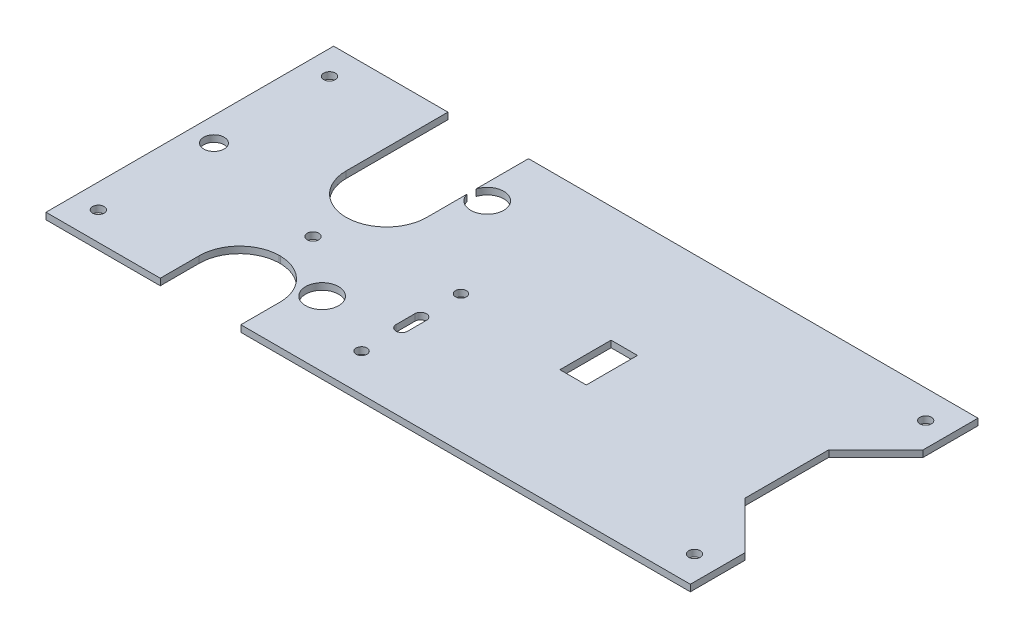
ISO-10303-21;
HEADER;
FILE_DESCRIPTION(('STEP AP214'),'2;1');
FILE_NAME('part.step','',(''),(''),'','','');
FILE_SCHEMA(('AUTOMOTIVE_DESIGN { 1 0 10303 214 1 1 1 1 }'));
ENDSEC;
DATA;
#1=APPLICATION_CONTEXT('core data for automotive mechanical design processes');
#2=APPLICATION_PROTOCOL_DEFINITION('international standard','automotive_design',2000,#1);
#3=PRODUCT_CONTEXT('',#1,'mechanical');
#4=PRODUCT('Part','Part','',(#3));
#5=PRODUCT_RELATED_PRODUCT_CATEGORY('part','',(#4));
#6=PRODUCT_DEFINITION_FORMATION('','',#4);
#7=PRODUCT_DEFINITION_CONTEXT('part definition',#1,'design');
#8=PRODUCT_DEFINITION('design','',#6,#7);
#9=PRODUCT_DEFINITION_SHAPE('','',#8);
#10=(LENGTH_UNIT() NAMED_UNIT(*) SI_UNIT(.MILLI.,.METRE.));
#11=(NAMED_UNIT(*) PLANE_ANGLE_UNIT() SI_UNIT($,.RADIAN.));
#12=(NAMED_UNIT(*) SI_UNIT($,.STERADIAN.) SOLID_ANGLE_UNIT());
#13=UNCERTAINTY_MEASURE_WITH_UNIT(LENGTH_MEASURE(1.E-05),#10,'distance_accuracy_value','');
#14=(GEOMETRIC_REPRESENTATION_CONTEXT(3) GLOBAL_UNCERTAINTY_ASSIGNED_CONTEXT((#13)) GLOBAL_UNIT_ASSIGNED_CONTEXT((#10,
#11,#12)) REPRESENTATION_CONTEXT('',''));
#15=CARTESIAN_POINT('',(0.,0.,0.));
#16=DIRECTION('',(0.,0.,1.));
#17=DIRECTION('',(1.,0.,0.));
#18=AXIS2_PLACEMENT_3D('',#15,#16,#17);
#19=CARTESIAN_POINT('',(0.,2.,-6.49709519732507));
#20=DIRECTION('',(0.,0.,-1.));
#21=DIRECTION('',(-1.,0.,0.));
#22=AXIS2_PLACEMENT_3D('',#19,#20,#21);
#23=PLANE('',#22);
#24=DIRECTION('',(1.,0.,0.));
#25=VECTOR('',#24,1.);
#26=CARTESIAN_POINT('',(0.,0.,-6.49709519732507));
#27=LINE('',#26,#25);
#28=CARTESIAN_POINT('',(29.8823938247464,0.,-6.49709519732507));
#29=VERTEX_POINT('',#28);
#30=CARTESIAN_POINT('',(37.8823938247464,0.,-6.49709519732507));
#31=VERTEX_POINT('',#30);
#32=EDGE_CURVE('E640',#29,#31,#27,.T.);
#33=ORIENTED_EDGE('',*,*,#32,.T.);
#34=DIRECTION('',(0.,-1.,0.));
#35=VECTOR('',#34,1.);
#36=CARTESIAN_POINT('',(37.8823938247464,2.,-6.49709519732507));
#37=LINE('',#36,#35);
#38=CARTESIAN_POINT('',(37.8823938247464,2.,-6.49709519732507));
#39=VERTEX_POINT('',#38);
#40=EDGE_CURVE('E12',#39,#31,#37,.T.);
#41=ORIENTED_EDGE('',*,*,#40,.F.);
#42=DIRECTION('',(1.,0.,0.));
#43=VECTOR('',#42,1.);
#44=CARTESIAN_POINT('',(0.,2.,-6.49709519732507));
#45=LINE('',#44,#43);
#46=CARTESIAN_POINT('',(29.8823938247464,2.,-6.49709519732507));
#47=VERTEX_POINT('',#46);
#48=EDGE_CURVE('E251',#47,#39,#45,.T.);
#49=ORIENTED_EDGE('',*,*,#48,.F.);
#50=DIRECTION('',(0.,-1.,0.));
#51=VECTOR('',#50,1.);
#52=CARTESIAN_POINT('',(29.8823938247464,2.,-6.49709519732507));
#53=LINE('',#52,#51);
#54=EDGE_CURVE('E59',#47,#29,#53,.T.);
#55=ORIENTED_EDGE('',*,*,#54,.T.);
#56=EDGE_LOOP('',(#33,#41,#49,#55));
#57=FACE_BOUND('',#56,.T.);
#58=ADVANCED_FACE('F40',(#57),#23,.F.);
#59=CARTESIAN_POINT('',(37.8823938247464,2.,0.));
#60=DIRECTION('',(1.,0.,0.));
#61=DIRECTION('',(0.,0.,-1.));
#62=AXIS2_PLACEMENT_3D('',#59,#60,#61);
#63=PLANE('',#62);
#64=DIRECTION('',(0.,0.,1.));
#65=VECTOR('',#64,1.);
#66=CARTESIAN_POINT('',(37.8823938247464,0.,0.));
#67=LINE('',#66,#65);
#68=CARTESIAN_POINT('',(37.8823938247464,0.,9.00290480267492));
#69=VERTEX_POINT('',#68);
#70=EDGE_CURVE('E258',#31,#69,#67,.T.);
#71=ORIENTED_EDGE('',*,*,#70,.T.);
#72=DIRECTION('',(0.,-1.,0.));
#73=VECTOR('',#72,1.);
#74=CARTESIAN_POINT('',(37.8823938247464,2.,9.00290480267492));
#75=LINE('',#74,#73);
#76=CARTESIAN_POINT('',(37.8823938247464,2.,9.00290480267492));
#77=VERTEX_POINT('',#76);
#78=EDGE_CURVE('E50',#77,#69,#75,.T.);
#79=ORIENTED_EDGE('',*,*,#78,.F.);
#80=DIRECTION('',(0.,0.,1.));
#81=VECTOR('',#80,1.);
#82=CARTESIAN_POINT('',(37.8823938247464,2.,0.));
#83=LINE('',#82,#81);
#84=EDGE_CURVE('E245',#39,#77,#83,.T.);
#85=ORIENTED_EDGE('',*,*,#84,.F.);
#86=ORIENTED_EDGE('',*,*,#40,.T.);
#87=EDGE_LOOP('',(#71,#79,#85,#86));
#88=FACE_BOUND('',#87,.T.);
#89=ADVANCED_FACE('F257',(#88),#63,.F.);
#90=CARTESIAN_POINT('',(0.,2.,9.00290480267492));
#91=DIRECTION('',(0.,0.,-1.));
#92=DIRECTION('',(-1.,0.,0.));
#93=AXIS2_PLACEMENT_3D('',#90,#91,#92);
#94=PLANE('',#93);
#95=DIRECTION('',(1.,0.,0.));
#96=VECTOR('',#95,1.);
#97=CARTESIAN_POINT('',(0.,0.,9.00290480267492));
#98=LINE('',#97,#96);
#99=CARTESIAN_POINT('',(29.8823938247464,0.,9.00290480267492));
#100=VERTEX_POINT('',#99);
#101=EDGE_CURVE('E467',#100,#69,#98,.T.);
#102=ORIENTED_EDGE('',*,*,#101,.F.);
#103=DIRECTION('',(0.,-1.,0.));
#104=VECTOR('',#103,1.);
#105=CARTESIAN_POINT('',(29.8823938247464,2.,9.00290480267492));
#106=LINE('',#105,#104);
#107=CARTESIAN_POINT('',(29.8823938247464,2.,9.00290480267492));
#108=VERTEX_POINT('',#107);
#109=EDGE_CURVE('E151',#108,#100,#106,.T.);
#110=ORIENTED_EDGE('',*,*,#109,.F.);
#111=DIRECTION('',(1.,0.,0.));
#112=VECTOR('',#111,1.);
#113=CARTESIAN_POINT('',(0.,2.,9.00290480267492));
#114=LINE('',#113,#112);
#115=EDGE_CURVE('E250',#108,#77,#114,.T.);
#116=ORIENTED_EDGE('',*,*,#115,.T.);
#117=ORIENTED_EDGE('',*,*,#78,.T.);
#118=EDGE_LOOP('',(#102,#110,#116,#117));
#119=FACE_BOUND('',#118,.T.);
#120=ADVANCED_FACE('F262',(#119),#94,.T.);
#121=CARTESIAN_POINT('',(-25.4176286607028,2.,-24.2971031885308));
#122=DIRECTION('',(0.,-1.,0.));
#123=DIRECTION('',(0.,0.,-1.));
#124=AXIS2_PLACEMENT_3D('',#121,#122,#123);
#125=CYLINDRICAL_SURFACE('',#124,4.99999999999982);
#126=CARTESIAN_POINT('',(-25.4176286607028,0.,-24.2971031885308));
#127=DIRECTION('',(0.,1.,0.));
#128=DIRECTION('',(0.,0.,1.));
#129=AXIS2_PLACEMENT_3D('',#126,#127,#128);
#130=CIRCLE('',#129,4.99999999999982);
#131=CARTESIAN_POINT('',(-30.2176061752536,0.,-22.8970260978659));
#132=VERTEX_POINT('',#131);
#133=CARTESIAN_POINT('',(-30.2176061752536,0.,-25.6971802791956));
#134=VERTEX_POINT('',#133);
#135=EDGE_CURVE('E553',#132,#134,#130,.T.);
#136=ORIENTED_EDGE('',*,*,#135,.F.);
#137=DIRECTION('',(0.,-1.,0.));
#138=VECTOR('',#137,1.);
#139=CARTESIAN_POINT('',(-30.2176061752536,2.,-22.8970260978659));
#140=LINE('',#139,#138);
#141=CARTESIAN_POINT('',(-30.2176061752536,2.,-22.8970260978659));
#142=VERTEX_POINT('',#141);
#143=EDGE_CURVE('E474',#142,#132,#140,.T.);
#144=ORIENTED_EDGE('',*,*,#143,.F.);
#145=CARTESIAN_POINT('',(-25.4176286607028,2.,-24.2971031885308));
#146=DIRECTION('',(0.,1.,0.));
#147=DIRECTION('',(0.,0.,1.));
#148=AXIS2_PLACEMENT_3D('',#145,#146,#147);
#149=CIRCLE('',#148,4.99999999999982);
#150=CARTESIAN_POINT('',(-30.2176061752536,2.,-25.6971802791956));
#151=VERTEX_POINT('',#150);
#152=EDGE_CURVE('E430',#142,#151,#149,.T.);
#153=ORIENTED_EDGE('',*,*,#152,.T.);
#154=DIRECTION('',(0.,-1.,0.));
#155=VECTOR('',#154,1.);
#156=CARTESIAN_POINT('',(-30.2176061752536,2.,-25.6971802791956));
#157=LINE('',#156,#155);
#158=EDGE_CURVE('E476',#151,#134,#157,.T.);
#159=ORIENTED_EDGE('',*,*,#158,.T.);
#160=EDGE_LOOP('',(#136,#144,#153,#159));
#161=FACE_BOUND('',#160,.T.);
#162=ADVANCED_FACE('F776',(#161),#125,.F.);
#163=CARTESIAN_POINT('',(-30.2176061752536,2.,0.));
#164=DIRECTION('',(-1.,0.,0.));
#165=DIRECTION('',(0.,0.,1.));
#166=AXIS2_PLACEMENT_3D('',#163,#164,#165);
#167=PLANE('',#166);
#168=DIRECTION('',(0.,0.,-1.));
#169=VECTOR('',#168,1.);
#170=CARTESIAN_POINT('',(-30.2176061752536,0.,0.));
#171=LINE('',#170,#169);
#172=CARTESIAN_POINT('',(-30.2176061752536,0.,-10.7970951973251));
#173=VERTEX_POINT('',#172);
#174=EDGE_CURVE('E556',#173,#132,#171,.T.);
#175=ORIENTED_EDGE('',*,*,#174,.F.);
#176=DIRECTION('',(0.,-1.,0.));
#177=VECTOR('',#176,1.);
#178=CARTESIAN_POINT('',(-30.2176061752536,2.,-10.7970951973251));
#179=LINE('',#178,#177);
#180=CARTESIAN_POINT('',(-30.2176061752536,2.,-10.7970951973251));
#181=VERTEX_POINT('',#180);
#182=EDGE_CURVE('E518',#181,#173,#179,.T.);
#183=ORIENTED_EDGE('',*,*,#182,.F.);
#184=DIRECTION('',(0.,0.,-1.));
#185=VECTOR('',#184,1.);
#186=CARTESIAN_POINT('',(-30.2176061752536,2.,0.));
#187=LINE('',#186,#185);
#188=EDGE_CURVE('E426',#181,#142,#187,.T.);
#189=ORIENTED_EDGE('',*,*,#188,.T.);
#190=ORIENTED_EDGE('',*,*,#143,.T.);
#191=EDGE_LOOP('',(#175,#183,#189,#190));
#192=FACE_BOUND('',#191,.T.);
#193=ADVANCED_FACE('F772',(#192),#167,.T.);
#194=CARTESIAN_POINT('',(-42.4176061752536,2.,-10.7970951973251));
#195=DIRECTION('',(0.,-1.,0.));
#196=DIRECTION('',(0.,0.,-1.));
#197=AXIS2_PLACEMENT_3D('',#194,#195,#196);
#198=CYLINDRICAL_SURFACE('',#197,12.2);
#199=CARTESIAN_POINT('',(-42.4176061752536,0.,-10.7970951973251));
#200=DIRECTION('',(0.,1.,0.));
#201=DIRECTION('',(0.,0.,1.));
#202=AXIS2_PLACEMENT_3D('',#199,#200,#201);
#203=CIRCLE('',#202,12.2);
#204=CARTESIAN_POINT('',(-42.163439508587,0.,1.40025694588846));
#205=VERTEX_POINT('',#204);
#206=EDGE_CURVE('E559',#205,#173,#203,.T.);
#207=ORIENTED_EDGE('',*,*,#206,.F.);
#208=DIRECTION('',(0.,-1.,0.));
#209=VECTOR('',#208,1.);
#210=CARTESIAN_POINT('',(-42.163439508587,2.,1.40025694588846));
#211=LINE('',#210,#209);
#212=CARTESIAN_POINT('',(-42.163439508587,2.,1.40025694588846));
#213=VERTEX_POINT('',#212);
#214=EDGE_CURVE('E516',#213,#205,#211,.T.);
#215=ORIENTED_EDGE('',*,*,#214,.F.);
#216=CARTESIAN_POINT('',(-42.4176061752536,2.,-10.7970951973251));
#217=DIRECTION('',(0.,1.,0.));
#218=DIRECTION('',(0.,0.,1.));
#219=AXIS2_PLACEMENT_3D('',#216,#217,#218);
#220=CIRCLE('',#219,12.2);
#221=EDGE_CURVE('E418',#213,#181,#220,.T.);
#222=ORIENTED_EDGE('',*,*,#221,.T.);
#223=ORIENTED_EDGE('',*,*,#182,.T.);
#224=EDGE_LOOP('',(#207,#215,#222,#223));
#225=FACE_BOUND('',#224,.T.);
#226=ADVANCED_FACE('F768',(#225),#198,.F.);
#227=CARTESIAN_POINT('',(-8.02783955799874E-13,2.,1.40025694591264));
#228=DIRECTION('',(5.7331188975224E-13,0.,-1.));
#229=DIRECTION('',(-1.,0.,-5.7331188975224E-13));
#230=AXIS2_PLACEMENT_3D('',#227,#228,#229);
#231=PLANE('',#230);
#232=DIRECTION('',(1.,0.,5.7331188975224E-13));
#233=VECTOR('',#232,1.);
#234=CARTESIAN_POINT('',(-8.02783955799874E-13,0.,1.40025694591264));
#235=LINE('',#234,#233);
#236=CARTESIAN_POINT('',(-42.671772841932,0.,1.40025694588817));
#237=VERTEX_POINT('',#236);
#238=EDGE_CURVE('E562',#237,#205,#235,.T.);
#239=ORIENTED_EDGE('',*,*,#238,.F.);
#240=DIRECTION('',(0.,-1.,0.));
#241=VECTOR('',#240,1.);
#242=CARTESIAN_POINT('',(-42.671772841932,2.,1.40025694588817));
#243=LINE('',#242,#241);
#244=CARTESIAN_POINT('',(-42.671772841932,2.,1.40025694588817));
#245=VERTEX_POINT('',#244);
#246=EDGE_CURVE('E514',#245,#237,#243,.T.);
#247=ORIENTED_EDGE('',*,*,#246,.F.);
#248=DIRECTION('',(1.,0.,5.7331188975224E-13));
#249=VECTOR('',#248,1.);
#250=CARTESIAN_POINT('',(-8.02783955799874E-13,2.,1.40025694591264));
#251=LINE('',#250,#249);
#252=EDGE_CURVE('E413',#245,#213,#251,.T.);
#253=ORIENTED_EDGE('',*,*,#252,.T.);
#254=ORIENTED_EDGE('',*,*,#214,.T.);
#255=EDGE_LOOP('',(#239,#247,#253,#254));
#256=FACE_BOUND('',#255,.T.);
#257=ADVANCED_FACE('F764',(#256),#231,.T.);
#258=CARTESIAN_POINT('',(-42.4176061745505,2.,-10.7970951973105));
#259=DIRECTION('',(0.,-1.,0.));
#260=DIRECTION('',(0.,0.,-1.));
#261=AXIS2_PLACEMENT_3D('',#258,#259,#260);
#262=CYLINDRICAL_SURFACE('',#261,12.2);
#263=CARTESIAN_POINT('',(-42.4176061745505,0.,-10.7970951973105));
#264=DIRECTION('',(0.,1.,0.));
#265=DIRECTION('',(0.,0.,1.));
#266=AXIS2_PLACEMENT_3D('',#263,#264,#265);
#267=CIRCLE('',#266,12.2);
#268=CARTESIAN_POINT('',(-54.6176061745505,0.,-10.7970951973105));
#269=VERTEX_POINT('',#268);
#270=EDGE_CURVE('E565',#269,#237,#267,.T.);
#271=ORIENTED_EDGE('',*,*,#270,.F.);
#272=DIRECTION('',(0.,-1.,0.));
#273=VECTOR('',#272,1.);
#274=CARTESIAN_POINT('',(-54.6176061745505,2.,-10.7970951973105));
#275=LINE('',#274,#273);
#276=CARTESIAN_POINT('',(-54.6176061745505,2.,-10.7970951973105));
#277=VERTEX_POINT('',#276);
#278=EDGE_CURVE('E512',#277,#269,#275,.T.);
#279=ORIENTED_EDGE('',*,*,#278,.F.);
#280=CARTESIAN_POINT('',(-42.4176061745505,2.,-10.7970951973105));
#281=DIRECTION('',(0.,1.,0.));
#282=DIRECTION('',(0.,0.,1.));
#283=AXIS2_PLACEMENT_3D('',#280,#281,#282);
#284=CIRCLE('',#283,12.2);
#285=EDGE_CURVE('E408',#277,#245,#284,.T.);
#286=ORIENTED_EDGE('',*,*,#285,.T.);
#287=ORIENTED_EDGE('',*,*,#246,.T.);
#288=EDGE_LOOP('',(#271,#279,#286,#287));
#289=FACE_BOUND('',#288,.T.);
#290=ADVANCED_FACE('F760',(#289),#262,.F.);
#291=CARTESIAN_POINT('',(-54.6176061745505,2.,0.));
#292=DIRECTION('',(1.,0.,0.));
#293=DIRECTION('',(0.,0.,-1.));
#294=AXIS2_PLACEMENT_3D('',#291,#292,#293);
#295=PLANE('',#294);
#296=DIRECTION('',(0.,0.,1.));
#297=VECTOR('',#296,1.);
#298=CARTESIAN_POINT('',(-54.6176061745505,0.,0.));
#299=LINE('',#298,#297);
#300=CARTESIAN_POINT('',(-54.6176061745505,0.,-41.5970951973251));
#301=VERTEX_POINT('',#300);
#302=EDGE_CURVE('E568',#301,#269,#299,.T.);
#303=ORIENTED_EDGE('',*,*,#302,.F.);
#304=DIRECTION('',(0.,-1.,0.));
#305=VECTOR('',#304,1.);
#306=CARTESIAN_POINT('',(-54.6176061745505,2.,-41.5970951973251));
#307=LINE('',#306,#305);
#308=CARTESIAN_POINT('',(-54.6176061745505,2.,-41.5970951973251));
#309=VERTEX_POINT('',#308);
#310=EDGE_CURVE('E510',#309,#301,#307,.T.);
#311=ORIENTED_EDGE('',*,*,#310,.F.);
#312=DIRECTION('',(0.,0.,1.));
#313=VECTOR('',#312,1.);
#314=CARTESIAN_POINT('',(-54.6176061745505,2.,0.));
#315=LINE('',#314,#313);
#316=EDGE_CURVE('E404',#309,#277,#315,.T.);
#317=ORIENTED_EDGE('',*,*,#316,.T.);
#318=ORIENTED_EDGE('',*,*,#278,.T.);
#319=EDGE_LOOP('',(#303,#311,#317,#318));
#320=FACE_BOUND('',#319,.T.);
#321=ADVANCED_FACE('F756',(#320),#295,.T.);
#322=CARTESIAN_POINT('',(0.,2.,-41.5970951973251));
#323=DIRECTION('',(0.,0.,-1.));
#324=DIRECTION('',(-1.,0.,0.));
#325=AXIS2_PLACEMENT_3D('',#322,#323,#324);
#326=PLANE('',#325);
#327=DIRECTION('',(1.,0.,0.));
#328=VECTOR('',#327,1.);
#329=CARTESIAN_POINT('',(0.,0.,-41.5970951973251));
#330=LINE('',#329,#328);
#331=CARTESIAN_POINT('',(-89.2176061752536,0.,-41.5970951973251));
#332=VERTEX_POINT('',#331);
#333=EDGE_CURVE('E571',#332,#301,#330,.T.);
#334=ORIENTED_EDGE('',*,*,#333,.F.);
#335=DIRECTION('',(0.,-1.,0.));
#336=VECTOR('',#335,1.);
#337=CARTESIAN_POINT('',(-89.2176061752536,2.,-41.5970951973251));
#338=LINE('',#337,#336);
#339=CARTESIAN_POINT('',(-89.2176061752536,2.,-41.5970951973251));
#340=VERTEX_POINT('',#339);
#341=EDGE_CURVE('E508',#340,#332,#338,.T.);
#342=ORIENTED_EDGE('',*,*,#341,.F.);
#343=DIRECTION('',(1.,0.,0.));
#344=VECTOR('',#343,1.);
#345=CARTESIAN_POINT('',(0.,2.,-41.5970951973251));
#346=LINE('',#345,#344);
#347=EDGE_CURVE('E396',#340,#309,#346,.T.);
#348=ORIENTED_EDGE('',*,*,#347,.T.);
#349=ORIENTED_EDGE('',*,*,#310,.T.);
#350=EDGE_LOOP('',(#334,#342,#348,#349));
#351=FACE_BOUND('',#350,.T.);
#352=ADVANCED_FACE('F752',(#351),#326,.T.);
#353=CARTESIAN_POINT('',(-89.2176061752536,2.,0.));
#354=DIRECTION('',(1.,0.,0.));
#355=DIRECTION('',(0.,0.,-1.));
#356=AXIS2_PLACEMENT_3D('',#353,#354,#355);
#357=PLANE('',#356);
#358=DIRECTION('',(0.,0.,1.));
#359=VECTOR('',#358,1.);
#360=CARTESIAN_POINT('',(-89.2176061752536,0.,0.));
#361=LINE('',#360,#359);
#362=CARTESIAN_POINT('',(-89.2176061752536,0.,45.5029048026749));
#363=VERTEX_POINT('',#362);
#364=EDGE_CURVE('E574',#332,#363,#361,.T.);
#365=ORIENTED_EDGE('',*,*,#364,.T.);
#366=DIRECTION('',(0.,-1.,0.));
#367=VECTOR('',#366,1.);
#368=CARTESIAN_POINT('',(-89.2176061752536,2.,45.5029048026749));
#369=LINE('',#368,#367);
#370=CARTESIAN_POINT('',(-89.2176061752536,2.,45.5029048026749));
#371=VERTEX_POINT('',#370);
#372=EDGE_CURVE('E505',#371,#363,#369,.T.);
#373=ORIENTED_EDGE('',*,*,#372,.F.);
#374=DIRECTION('',(0.,0.,1.));
#375=VECTOR('',#374,1.);
#376=CARTESIAN_POINT('',(-89.2176061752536,2.,0.));
#377=LINE('',#376,#375);
#378=EDGE_CURVE('E391',#340,#371,#377,.T.);
#379=ORIENTED_EDGE('',*,*,#378,.F.);
#380=ORIENTED_EDGE('',*,*,#341,.T.);
#381=EDGE_LOOP('',(#365,#373,#379,#380));
#382=FACE_BOUND('',#381,.T.);
#383=ADVANCED_FACE('F748',(#382),#357,.F.);
#384=CARTESIAN_POINT('',(0.,2.,45.5029048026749));
#385=DIRECTION('',(0.,0.,-1.));
#386=DIRECTION('',(-1.,0.,0.));
#387=AXIS2_PLACEMENT_3D('',#384,#385,#386);
#388=PLANE('',#387);
#389=DIRECTION('',(1.,0.,0.));
#390=VECTOR('',#389,1.);
#391=CARTESIAN_POINT('',(0.,0.,45.5029048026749));
#392=LINE('',#391,#390);
#393=CARTESIAN_POINT('',(-54.6176061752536,0.,45.5029048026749));
#394=VERTEX_POINT('',#393);
#395=EDGE_CURVE('E577',#363,#394,#392,.T.);
#396=ORIENTED_EDGE('',*,*,#395,.T.);
#397=DIRECTION('',(0.,-1.,0.));
#398=VECTOR('',#397,1.);
#399=CARTESIAN_POINT('',(-54.6176061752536,2.,45.5029048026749));
#400=LINE('',#399,#398);
#401=CARTESIAN_POINT('',(-54.6176061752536,2.,45.5029048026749));
#402=VERTEX_POINT('',#401);
#403=EDGE_CURVE('E503',#402,#394,#400,.T.);
#404=ORIENTED_EDGE('',*,*,#403,.F.);
#405=DIRECTION('',(1.,0.,0.));
#406=VECTOR('',#405,1.);
#407=CARTESIAN_POINT('',(0.,2.,45.5029048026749));
#408=LINE('',#407,#406);
#409=EDGE_CURVE('E387',#371,#402,#408,.T.);
#410=ORIENTED_EDGE('',*,*,#409,.F.);
#411=ORIENTED_EDGE('',*,*,#372,.T.);
#412=EDGE_LOOP('',(#396,#404,#410,#411));
#413=FACE_BOUND('',#412,.T.);
#414=ADVANCED_FACE('F744',(#413),#388,.F.);
#415=CARTESIAN_POINT('',(-54.6176061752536,2.,0.));
#416=DIRECTION('',(1.,0.,0.));
#417=DIRECTION('',(0.,0.,-1.));
#418=AXIS2_PLACEMENT_3D('',#415,#416,#417);
#419=PLANE('',#418);
#420=DIRECTION('',(0.,0.,1.));
#421=VECTOR('',#420,1.);
#422=CARTESIAN_POINT('',(-54.6176061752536,0.,0.));
#423=LINE('',#422,#421);
#424=CARTESIAN_POINT('',(-54.6176061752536,0.,33.7029048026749));
#425=VERTEX_POINT('',#424);
#426=EDGE_CURVE('E580',#425,#394,#423,.T.);
#427=ORIENTED_EDGE('',*,*,#426,.F.);
#428=DIRECTION('',(0.,-1.,0.));
#429=VECTOR('',#428,1.);
#430=CARTESIAN_POINT('',(-54.6176061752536,2.,33.7029048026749));
#431=LINE('',#430,#429);
#432=CARTESIAN_POINT('',(-54.6176061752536,2.,33.7029048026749));
#433=VERTEX_POINT('',#432);
#434=EDGE_CURVE('E501',#433,#425,#431,.T.);
#435=ORIENTED_EDGE('',*,*,#434,.F.);
#436=DIRECTION('',(0.,0.,1.));
#437=VECTOR('',#436,1.);
#438=CARTESIAN_POINT('',(-54.6176061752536,2.,0.));
#439=LINE('',#438,#437);
#440=EDGE_CURVE('E383',#433,#402,#439,.T.);
#441=ORIENTED_EDGE('',*,*,#440,.T.);
#442=ORIENTED_EDGE('',*,*,#403,.T.);
#443=EDGE_LOOP('',(#427,#435,#441,#442));
#444=FACE_BOUND('',#443,.T.);
#445=ADVANCED_FACE('F740',(#444),#419,.T.);
#446=CARTESIAN_POINT('',(-42.4176061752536,2.,33.7029048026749));
#447=DIRECTION('',(0.,-1.,0.));
#448=DIRECTION('',(0.,0.,-1.));
#449=AXIS2_PLACEMENT_3D('',#446,#447,#448);
#450=CYLINDRICAL_SURFACE('',#449,12.2);
#451=CARTESIAN_POINT('',(-42.4176061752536,0.,33.7029048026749));
#452=DIRECTION('',(0.,1.,0.));
#453=DIRECTION('',(0.,0.,1.));
#454=AXIS2_PLACEMENT_3D('',#451,#452,#453);
#455=CIRCLE('',#454,12.2);
#456=CARTESIAN_POINT('',(-42.6689869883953,0.,21.5054949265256));
#457=VERTEX_POINT('',#456);
#458=EDGE_CURVE('E583',#457,#425,#455,.T.);
#459=ORIENTED_EDGE('',*,*,#458,.F.);
#460=DIRECTION('',(0.,-1.,0.));
#461=VECTOR('',#460,1.);
#462=CARTESIAN_POINT('',(-42.6689869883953,2.,21.5054949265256));
#463=LINE('',#462,#461);
#464=CARTESIAN_POINT('',(-42.6689869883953,2.,21.5054949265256));
#465=VERTEX_POINT('',#464);
#466=EDGE_CURVE('E499',#465,#457,#463,.T.);
#467=ORIENTED_EDGE('',*,*,#466,.F.);
#468=CARTESIAN_POINT('',(-42.4176061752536,2.,33.7029048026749));
#469=DIRECTION('',(0.,1.,0.));
#470=DIRECTION('',(0.,0.,1.));
#471=AXIS2_PLACEMENT_3D('',#468,#469,#470);
#472=CIRCLE('',#471,12.2);
#473=EDGE_CURVE('E375',#465,#433,#472,.T.);
#474=ORIENTED_EDGE('',*,*,#473,.T.);
#475=ORIENTED_EDGE('',*,*,#434,.T.);
#476=EDGE_LOOP('',(#459,#467,#474,#475));
#477=FACE_BOUND('',#476,.T.);
#478=ADVANCED_FACE('F736',(#477),#450,.F.);
#479=CARTESIAN_POINT('',(0.,2.,21.5054949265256));
#480=DIRECTION('',(0.,0.,-1.));
#481=DIRECTION('',(-1.,0.,0.));
#482=AXIS2_PLACEMENT_3D('',#479,#480,#481);
#483=PLANE('',#482);
#484=DIRECTION('',(1.,0.,0.));
#485=VECTOR('',#484,1.);
#486=CARTESIAN_POINT('',(0.,0.,21.5054949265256));
#487=LINE('',#486,#485);
#488=CARTESIAN_POINT('',(-42.1662253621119,0.,21.5054949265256));
#489=VERTEX_POINT('',#488);
#490=EDGE_CURVE('E586',#457,#489,#487,.T.);
#491=ORIENTED_EDGE('',*,*,#490,.T.);
#492=DIRECTION('',(0.,-1.,0.));
#493=VECTOR('',#492,1.);
#494=CARTESIAN_POINT('',(-42.1662253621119,2.,21.5054949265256));
#495=LINE('',#494,#493);
#496=CARTESIAN_POINT('',(-42.1662253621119,2.,21.5054949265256));
#497=VERTEX_POINT('',#496);
#498=EDGE_CURVE('E497',#497,#489,#495,.T.);
#499=ORIENTED_EDGE('',*,*,#498,.F.);
#500=DIRECTION('',(1.,0.,0.));
#501=VECTOR('',#500,1.);
#502=CARTESIAN_POINT('',(0.,2.,21.5054949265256));
#503=LINE('',#502,#501);
#504=EDGE_CURVE('E371',#465,#497,#503,.T.);
#505=ORIENTED_EDGE('',*,*,#504,.F.);
#506=ORIENTED_EDGE('',*,*,#466,.T.);
#507=EDGE_LOOP('',(#491,#499,#505,#506));
#508=FACE_BOUND('',#507,.T.);
#509=ADVANCED_FACE('F732',(#508),#483,.F.);
#510=CARTESIAN_POINT('',(-42.4176061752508,2.,33.7029048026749));
#511=DIRECTION('',(0.,-1.,0.));
#512=DIRECTION('',(0.,0.,-1.));
#513=AXIS2_PLACEMENT_3D('',#510,#511,#512);
#514=CYLINDRICAL_SURFACE('',#513,12.2);
#515=CARTESIAN_POINT('',(-42.4176061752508,0.,33.7029048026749));
#516=DIRECTION('',(0.,1.,0.));
#517=DIRECTION('',(0.,0.,1.));
#518=AXIS2_PLACEMENT_3D('',#515,#516,#517);
#519=CIRCLE('',#518,12.2);
#520=CARTESIAN_POINT('',(-30.2176061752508,0.,33.702904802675));
#521=VERTEX_POINT('',#520);
#522=EDGE_CURVE('E589',#521,#489,#519,.T.);
#523=ORIENTED_EDGE('',*,*,#522,.F.);
#524=DIRECTION('',(0.,-1.,0.));
#525=VECTOR('',#524,1.);
#526=CARTESIAN_POINT('',(-30.2176061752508,2.,33.702904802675));
#527=LINE('',#526,#525);
#528=CARTESIAN_POINT('',(-30.2176061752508,2.,33.702904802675));
#529=VERTEX_POINT('',#528);
#530=EDGE_CURVE('E495',#529,#521,#527,.T.);
#531=ORIENTED_EDGE('',*,*,#530,.F.);
#532=CARTESIAN_POINT('',(-42.4176061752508,2.,33.7029048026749));
#533=DIRECTION('',(0.,1.,0.));
#534=DIRECTION('',(0.,0.,1.));
#535=AXIS2_PLACEMENT_3D('',#532,#533,#534);
#536=CIRCLE('',#535,12.2);
#537=EDGE_CURVE('E366',#529,#497,#536,.T.);
#538=ORIENTED_EDGE('',*,*,#537,.T.);
#539=ORIENTED_EDGE('',*,*,#498,.T.);
#540=EDGE_LOOP('',(#523,#531,#538,#539));
#541=FACE_BOUND('',#540,.T.);
#542=ADVANCED_FACE('F728',(#541),#514,.F.);
#543=CARTESIAN_POINT('',(-30.2176061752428,2.,-7.21430219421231E-12));
#544=DIRECTION('',(-1.,0.,-2.38744993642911E-13));
#545=DIRECTION('',(-2.38744993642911E-13,0.,1.));
#546=AXIS2_PLACEMENT_3D('',#543,#544,#545);
#547=PLANE('',#546);
#548=DIRECTION('',(2.38744993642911E-13,0.,-1.));
#549=VECTOR('',#548,1.);
#550=CARTESIAN_POINT('',(-30.2176061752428,0.,-7.21430219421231E-12));
#551=LINE('',#550,#549);
#552=CARTESIAN_POINT('',(-30.2176061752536,0.,45.5029048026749));
#553=VERTEX_POINT('',#552);
#554=EDGE_CURVE('E592',#553,#521,#551,.T.);
#555=ORIENTED_EDGE('',*,*,#554,.F.);
#556=DIRECTION('',(0.,-1.,0.));
#557=VECTOR('',#556,1.);
#558=CARTESIAN_POINT('',(-30.2176061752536,2.,45.5029048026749));
#559=LINE('',#558,#557);
#560=CARTESIAN_POINT('',(-30.2176061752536,2.,45.5029048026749));
#561=VERTEX_POINT('',#560);
#562=EDGE_CURVE('E493',#561,#553,#559,.T.);
#563=ORIENTED_EDGE('',*,*,#562,.F.);
#564=DIRECTION('',(2.38744993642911E-13,0.,-1.));
#565=VECTOR('',#564,1.);
#566=CARTESIAN_POINT('',(-30.2176061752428,2.,-7.21430219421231E-12));
#567=LINE('',#566,#565);
#568=EDGE_CURVE('E362',#561,#529,#567,.T.);
#569=ORIENTED_EDGE('',*,*,#568,.T.);
#570=ORIENTED_EDGE('',*,*,#530,.T.);
#571=EDGE_LOOP('',(#555,#563,#569,#570));
#572=FACE_BOUND('',#571,.T.);
#573=ADVANCED_FACE('F724',(#572),#547,.T.);
#574=CARTESIAN_POINT('',(0.,2.,45.5029048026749));
#575=DIRECTION('',(0.,0.,-1.));
#576=DIRECTION('',(-1.,0.,0.));
#577=AXIS2_PLACEMENT_3D('',#574,#575,#576);
#578=PLANE('',#577);
#579=DIRECTION('',(1.,0.,0.));
#580=VECTOR('',#579,1.);
#581=CARTESIAN_POINT('',(0.,0.,45.5029048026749));
#582=LINE('',#581,#580);
#583=CARTESIAN_POINT('',(105.882393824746,0.,45.5029048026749));
#584=VERTEX_POINT('',#583);
#585=EDGE_CURVE('E595',#553,#584,#582,.T.);
#586=ORIENTED_EDGE('',*,*,#585,.T.);
#587=DIRECTION('',(0.,-1.,0.));
#588=VECTOR('',#587,1.);
#589=CARTESIAN_POINT('',(105.882393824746,2.,45.5029048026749));
#590=LINE('',#589,#588);
#591=CARTESIAN_POINT('',(105.882393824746,2.,45.5029048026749));
#592=VERTEX_POINT('',#591);
#593=EDGE_CURVE('E490',#592,#584,#590,.T.);
#594=ORIENTED_EDGE('',*,*,#593,.F.);
#595=DIRECTION('',(1.,0.,0.));
#596=VECTOR('',#595,1.);
#597=CARTESIAN_POINT('',(0.,2.,45.5029048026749));
#598=LINE('',#597,#596);
#599=EDGE_CURVE('E354',#561,#592,#598,.T.);
#600=ORIENTED_EDGE('',*,*,#599,.F.);
#601=ORIENTED_EDGE('',*,*,#562,.T.);
#602=EDGE_LOOP('',(#586,#594,#600,#601));
#603=FACE_BOUND('',#602,.T.);
#604=ADVANCED_FACE('F720',(#603),#578,.F.);
#605=CARTESIAN_POINT('',(105.882393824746,2.,0.));
#606=DIRECTION('',(-1.,0.,0.));
#607=DIRECTION('',(0.,0.,1.));
#608=AXIS2_PLACEMENT_3D('',#605,#606,#607);
#609=PLANE('',#608);
#610=DIRECTION('',(0.,0.,-1.));
#611=VECTOR('',#610,1.);
#612=CARTESIAN_POINT('',(105.882393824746,0.,0.));
#613=LINE('',#612,#611);
#614=CARTESIAN_POINT('',(105.882393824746,0.,28.9171183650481));
#615=VERTEX_POINT('',#614);
#616=EDGE_CURVE('E598',#584,#615,#613,.T.);
#617=ORIENTED_EDGE('',*,*,#616,.T.);
#618=DIRECTION('',(0.,-1.,0.));
#619=VECTOR('',#618,1.);
#620=CARTESIAN_POINT('',(105.882393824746,2.,28.9171183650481));
#621=LINE('',#620,#619);
#622=CARTESIAN_POINT('',(105.882393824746,2.,28.9171183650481));
#623=VERTEX_POINT('',#622);
#624=EDGE_CURVE('E488',#623,#615,#621,.T.);
#625=ORIENTED_EDGE('',*,*,#624,.F.);
#626=DIRECTION('',(0.,0.,-1.));
#627=VECTOR('',#626,1.);
#628=CARTESIAN_POINT('',(105.882393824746,2.,0.));
#629=LINE('',#628,#627);
#630=EDGE_CURVE('E350',#592,#623,#629,.T.);
#631=ORIENTED_EDGE('',*,*,#630,.F.);
#632=ORIENTED_EDGE('',*,*,#593,.T.);
#633=EDGE_LOOP('',(#617,#625,#631,#632));
#634=FACE_BOUND('',#633,.T.);
#635=ADVANCED_FACE('F716',(#634),#609,.F.);
#636=CARTESIAN_POINT('',(38.4826377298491,2.,-38.4826377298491));
#637=DIRECTION('',(0.707106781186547,0.,-0.707106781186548));
#638=DIRECTION('',(-0.707106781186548,0.,-0.707106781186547));
#639=AXIS2_PLACEMENT_3D('',#636,#637,#638);
#640=PLANE('',#639);
#641=DIRECTION('',(0.707106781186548,0.,0.707106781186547));
#642=VECTOR('',#641,1.);
#643=CARTESIAN_POINT('',(38.4826377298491,0.,-38.4826377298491));
#644=LINE('',#643,#642);
#645=CARTESIAN_POINT('',(91.5823938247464,0.,14.6171183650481));
#646=VERTEX_POINT('',#645);
#647=EDGE_CURVE('E601',#646,#615,#644,.T.);
#648=ORIENTED_EDGE('',*,*,#647,.F.);
#649=DIRECTION('',(0.,-1.,0.));
#650=VECTOR('',#649,1.);
#651=CARTESIAN_POINT('',(91.5823938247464,2.,14.6171183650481));
#652=LINE('',#651,#650);
#653=CARTESIAN_POINT('',(91.5823938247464,2.,14.6171183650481));
#654=VERTEX_POINT('',#653);
#655=EDGE_CURVE('E486',#654,#646,#652,.T.);
#656=ORIENTED_EDGE('',*,*,#655,.F.);
#657=DIRECTION('',(0.707106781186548,0.,0.707106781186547));
#658=VECTOR('',#657,1.);
#659=CARTESIAN_POINT('',(38.4826377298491,2.,-38.4826377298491));
#660=LINE('',#659,#658);
#661=EDGE_CURVE('E345',#654,#623,#660,.T.);
#662=ORIENTED_EDGE('',*,*,#661,.T.);
#663=ORIENTED_EDGE('',*,*,#624,.T.);
#664=EDGE_LOOP('',(#648,#656,#662,#663));
#665=FACE_BOUND('',#664,.T.);
#666=ADVANCED_FACE('F712',(#665),#640,.T.);
#667=CARTESIAN_POINT('',(91.5823938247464,2.,0.));
#668=DIRECTION('',(1.,0.,0.));
#669=DIRECTION('',(0.,0.,-1.));
#670=AXIS2_PLACEMENT_3D('',#667,#668,#669);
#671=PLANE('',#670);
#672=DIRECTION('',(0.,0.,1.));
#673=VECTOR('',#672,1.);
#674=CARTESIAN_POINT('',(91.5823938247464,0.,0.));
#675=LINE('',#674,#673);
#676=CARTESIAN_POINT('',(91.5823938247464,0.,-10.7113087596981));
#677=VERTEX_POINT('',#676);
#678=EDGE_CURVE('E604',#677,#646,#675,.T.);
#679=ORIENTED_EDGE('',*,*,#678,.F.);
#680=DIRECTION('',(0.,-1.,0.));
#681=VECTOR('',#680,1.);
#682=CARTESIAN_POINT('',(91.5823938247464,2.,-10.7113087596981));
#683=LINE('',#682,#681);
#684=CARTESIAN_POINT('',(91.5823938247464,2.,-10.7113087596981));
#685=VERTEX_POINT('',#684);
#686=EDGE_CURVE('E484',#685,#677,#683,.T.);
#687=ORIENTED_EDGE('',*,*,#686,.F.);
#688=DIRECTION('',(0.,0.,1.));
#689=VECTOR('',#688,1.);
#690=CARTESIAN_POINT('',(91.5823938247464,2.,0.));
#691=LINE('',#690,#689);
#692=EDGE_CURVE('E341',#685,#654,#691,.T.);
#693=ORIENTED_EDGE('',*,*,#692,.T.);
#694=ORIENTED_EDGE('',*,*,#655,.T.);
#695=EDGE_LOOP('',(#679,#687,#693,#694));
#696=FACE_BOUND('',#695,.T.);
#697=ADVANCED_FACE('F708',(#696),#671,.T.);
#698=CARTESIAN_POINT('',(40.4355425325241,2.,40.4355425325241));
#699=DIRECTION('',(0.707106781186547,0.,0.707106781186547));
#700=DIRECTION('',(0.707106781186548,0.,-0.707106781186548));
#701=AXIS2_PLACEMENT_3D('',#698,#699,#700);
#702=PLANE('',#701);
#703=DIRECTION('',(-0.707106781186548,0.,0.707106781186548));
#704=VECTOR('',#703,1.);
#705=CARTESIAN_POINT('',(40.4355425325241,0.,40.4355425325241));
#706=LINE('',#705,#704);
#707=CARTESIAN_POINT('',(105.882393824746,0.,-25.0113087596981));
#708=VERTEX_POINT('',#707);
#709=EDGE_CURVE('E607',#708,#677,#706,.T.);
#710=ORIENTED_EDGE('',*,*,#709,.F.);
#711=DIRECTION('',(0.,-1.,0.));
#712=VECTOR('',#711,1.);
#713=CARTESIAN_POINT('',(105.882393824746,2.,-25.0113087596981));
#714=LINE('',#713,#712);
#715=CARTESIAN_POINT('',(105.882393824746,2.,-25.0113087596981));
#716=VERTEX_POINT('',#715);
#717=EDGE_CURVE('E482',#716,#708,#714,.T.);
#718=ORIENTED_EDGE('',*,*,#717,.F.);
#719=DIRECTION('',(-0.707106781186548,0.,0.707106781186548));
#720=VECTOR('',#719,1.);
#721=CARTESIAN_POINT('',(40.4355425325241,2.,40.4355425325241));
#722=LINE('',#721,#720);
#723=EDGE_CURVE('E333',#716,#685,#722,.T.);
#724=ORIENTED_EDGE('',*,*,#723,.T.);
#725=ORIENTED_EDGE('',*,*,#686,.T.);
#726=EDGE_LOOP('',(#710,#718,#724,#725));
#727=FACE_BOUND('',#726,.T.);
#728=ADVANCED_FACE('F704',(#727),#702,.T.);
#729=CARTESIAN_POINT('',(105.882393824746,2.,0.));
#730=DIRECTION('',(-1.,0.,0.));
#731=DIRECTION('',(0.,0.,1.));
#732=AXIS2_PLACEMENT_3D('',#729,#730,#731);
#733=PLANE('',#732);
#734=DIRECTION('',(0.,0.,-1.));
#735=VECTOR('',#734,1.);
#736=CARTESIAN_POINT('',(105.882393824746,0.,0.));
#737=LINE('',#736,#735);
#738=CARTESIAN_POINT('',(105.882393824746,0.,-41.5970951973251));
#739=VERTEX_POINT('',#738);
#740=EDGE_CURVE('E610',#708,#739,#737,.T.);
#741=ORIENTED_EDGE('',*,*,#740,.T.);
#742=DIRECTION('',(0.,-1.,0.));
#743=VECTOR('',#742,1.);
#744=CARTESIAN_POINT('',(105.882393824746,2.,-41.5970951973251));
#745=LINE('',#744,#743);
#746=CARTESIAN_POINT('',(105.882393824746,2.,-41.5970951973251));
#747=VERTEX_POINT('',#746);
#748=EDGE_CURVE('E480',#747,#739,#745,.T.);
#749=ORIENTED_EDGE('',*,*,#748,.F.);
#750=DIRECTION('',(0.,0.,-1.));
#751=VECTOR('',#750,1.);
#752=CARTESIAN_POINT('',(105.882393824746,2.,0.));
#753=LINE('',#752,#751);
#754=EDGE_CURVE('E329',#716,#747,#753,.T.);
#755=ORIENTED_EDGE('',*,*,#754,.F.);
#756=ORIENTED_EDGE('',*,*,#717,.T.);
#757=EDGE_LOOP('',(#741,#749,#755,#756));
#758=FACE_BOUND('',#757,.T.);
#759=ADVANCED_FACE('F700',(#758),#733,.F.);
#760=CARTESIAN_POINT('',(0.,2.,-41.5970951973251));
#761=DIRECTION('',(0.,0.,-1.));
#762=DIRECTION('',(-1.,0.,0.));
#763=AXIS2_PLACEMENT_3D('',#760,#761,#762);
#764=PLANE('',#763);
#765=DIRECTION('',(1.,0.,0.));
#766=VECTOR('',#765,1.);
#767=CARTESIAN_POINT('',(0.,0.,-41.5970951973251));
#768=LINE('',#767,#766);
#769=CARTESIAN_POINT('',(-30.2176061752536,0.,-41.5970951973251));
#770=VERTEX_POINT('',#769);
#771=EDGE_CURVE('E613',#770,#739,#768,.T.);
#772=ORIENTED_EDGE('',*,*,#771,.F.);
#773=DIRECTION('',(0.,-1.,0.));
#774=VECTOR('',#773,1.);
#775=CARTESIAN_POINT('',(-30.2176061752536,2.,-41.5970951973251));
#776=LINE('',#775,#774);
#777=CARTESIAN_POINT('',(-30.2176061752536,2.,-41.5970951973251));
#778=VERTEX_POINT('',#777);
#779=EDGE_CURVE('E478',#778,#770,#776,.T.);
#780=ORIENTED_EDGE('',*,*,#779,.F.);
#781=DIRECTION('',(1.,0.,0.));
#782=VECTOR('',#781,1.);
#783=CARTESIAN_POINT('',(0.,2.,-41.5970951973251));
#784=LINE('',#783,#782);
#785=EDGE_CURVE('E324',#778,#747,#784,.T.);
#786=ORIENTED_EDGE('',*,*,#785,.T.);
#787=ORIENTED_EDGE('',*,*,#748,.T.);
#788=EDGE_LOOP('',(#772,#780,#786,#787));
#789=FACE_BOUND('',#788,.T.);
#790=ADVANCED_FACE('F697',(#789),#764,.T.);
#791=CARTESIAN_POINT('',(-5.01760617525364,2.,21.9529048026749));
#792=DIRECTION('',(0.,-1.,0.));
#793=DIRECTION('',(0.,0.,-1.));
#794=AXIS2_PLACEMENT_3D('',#791,#792,#793);
#795=CYLINDRICAL_SURFACE('',#794,1.75);
#796=CARTESIAN_POINT('',(-5.01760617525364,0.,21.9529048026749));
#797=DIRECTION('',(0.,1.,0.));
#798=DIRECTION('',(0.,0.,1.));
#799=AXIS2_PLACEMENT_3D('',#796,#797,#798);
#800=CIRCLE('',#799,1.75);
#801=CARTESIAN_POINT('',(-6.76760617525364,0.,21.9529048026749));
#802=VERTEX_POINT('',#801);
#803=CARTESIAN_POINT('',(-3.26760617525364,0.,21.9529048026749));
#804=VERTEX_POINT('',#803);
#805=EDGE_CURVE('E534',#802,#804,#800,.T.);
#806=ORIENTED_EDGE('',*,*,#805,.F.);
#807=DIRECTION('',(0.,-1.,0.));
#808=VECTOR('',#807,1.);
#809=CARTESIAN_POINT('',(-6.76760617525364,2.,21.9529048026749));
#810=LINE('',#809,#808);
#811=CARTESIAN_POINT('',(-6.76760617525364,2.,21.9529048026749));
#812=VERTEX_POINT('',#811);
#813=EDGE_CURVE('E44',#812,#802,#810,.T.);
#814=ORIENTED_EDGE('',*,*,#813,.F.);
#815=CARTESIAN_POINT('',(-5.01760617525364,2.,21.9529048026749));
#816=DIRECTION('',(0.,1.,0.));
#817=DIRECTION('',(0.,0.,1.));
#818=AXIS2_PLACEMENT_3D('',#815,#816,#817);
#819=CIRCLE('',#818,1.75);
#820=CARTESIAN_POINT('',(-3.26760617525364,2.,21.9529048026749));
#821=VERTEX_POINT('',#820);
#822=EDGE_CURVE('E461',#812,#821,#819,.T.);
#823=ORIENTED_EDGE('',*,*,#822,.T.);
#824=DIRECTION('',(0.,-1.,0.));
#825=VECTOR('',#824,1.);
#826=CARTESIAN_POINT('',(-3.26760617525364,2.,21.9529048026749));
#827=LINE('',#826,#825);
#828=EDGE_CURVE('E267',#821,#804,#827,.T.);
#829=ORIENTED_EDGE('',*,*,#828,.T.);
#830=EDGE_LOOP('',(#806,#814,#823,#829));
#831=FACE_BOUND('',#830,.T.);
#832=ADVANCED_FACE('F42',(#831),#795,.F.);
#833=CARTESIAN_POINT('',(-6.76760617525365,2.,0.));
#834=DIRECTION('',(1.,0.,0.));
#835=DIRECTION('',(0.,0.,-1.));
#836=AXIS2_PLACEMENT_3D('',#833,#834,#835);
#837=PLANE('',#836);
#838=DIRECTION('',(0.,0.,1.));
#839=VECTOR('',#838,1.);
#840=CARTESIAN_POINT('',(-6.76760617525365,0.,0.));
#841=LINE('',#840,#839);
#842=CARTESIAN_POINT('',(-6.76760617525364,0.,16.2529048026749));
#843=VERTEX_POINT('',#842);
#844=EDGE_CURVE('E530',#843,#802,#841,.T.);
#845=ORIENTED_EDGE('',*,*,#844,.F.);
#846=DIRECTION('',(0.,-1.,0.));
#847=VECTOR('',#846,1.);
#848=CARTESIAN_POINT('',(-6.76760617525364,2.,16.2529048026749));
#849=LINE('',#848,#847);
#850=CARTESIAN_POINT('',(-6.76760617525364,2.,16.2529048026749));
#851=VERTEX_POINT('',#850);
#852=EDGE_CURVE('E523',#851,#843,#849,.T.);
#853=ORIENTED_EDGE('',*,*,#852,.F.);
#854=DIRECTION('',(0.,0.,1.));
#855=VECTOR('',#854,1.);
#856=CARTESIAN_POINT('',(-6.76760617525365,2.,0.));
#857=LINE('',#856,#855);
#858=EDGE_CURVE('E456',#851,#812,#857,.T.);
#859=ORIENTED_EDGE('',*,*,#858,.T.);
#860=ORIENTED_EDGE('',*,*,#813,.T.);
#861=EDGE_LOOP('',(#845,#853,#859,#860));
#862=FACE_BOUND('',#861,.T.);
#863=ADVANCED_FACE('F528',(#862),#837,.T.);
#864=CARTESIAN_POINT('',(-5.01760617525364,2.,16.2529048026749));
#865=DIRECTION('',(0.,-1.,0.));
#866=DIRECTION('',(0.,0.,-1.));
#867=AXIS2_PLACEMENT_3D('',#864,#865,#866);
#868=CYLINDRICAL_SURFACE('',#867,1.75);
#869=CARTESIAN_POINT('',(-5.01760617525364,0.,16.2529048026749));
#870=DIRECTION('',(0.,1.,0.));
#871=DIRECTION('',(0.,0.,1.));
#872=AXIS2_PLACEMENT_3D('',#869,#870,#871);
#873=CIRCLE('',#872,1.75);
#874=CARTESIAN_POINT('',(-3.26760617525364,0.,16.2529048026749));
#875=VERTEX_POINT('',#874);
#876=EDGE_CURVE('E541',#875,#843,#873,.T.);
#877=ORIENTED_EDGE('',*,*,#876,.F.);
#878=DIRECTION('',(0.,-1.,0.));
#879=VECTOR('',#878,1.);
#880=CARTESIAN_POINT('',(-3.26760617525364,2.,16.2529048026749));
#881=LINE('',#880,#879);
#882=CARTESIAN_POINT('',(-3.26760617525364,2.,16.2529048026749));
#883=VERTEX_POINT('',#882);
#884=EDGE_CURVE('E522',#883,#875,#881,.T.);
#885=ORIENTED_EDGE('',*,*,#884,.F.);
#886=CARTESIAN_POINT('',(-5.01760617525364,2.,16.2529048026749));
#887=DIRECTION('',(0.,1.,0.));
#888=DIRECTION('',(0.,0.,1.));
#889=AXIS2_PLACEMENT_3D('',#886,#887,#888);
#890=CIRCLE('',#889,1.75);
#891=EDGE_CURVE('E451',#883,#851,#890,.T.);
#892=ORIENTED_EDGE('',*,*,#891,.T.);
#893=ORIENTED_EDGE('',*,*,#852,.T.);
#894=EDGE_LOOP('',(#877,#885,#892,#893));
#895=FACE_BOUND('',#894,.T.);
#896=ADVANCED_FACE('F667',(#895),#868,.F.);
#897=CARTESIAN_POINT('',(-81.9176061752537,2.,-33.0470951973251));
#898=DIRECTION('',(0.,-1.,0.));
#899=DIRECTION('',(0.,0.,-1.));
#900=AXIS2_PLACEMENT_3D('',#897,#898,#899);
#901=CYLINDRICAL_SURFACE('',#900,1.75);
#902=CARTESIAN_POINT('',(-81.9176061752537,2.,-33.0470951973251));
#903=DIRECTION('',(0.,1.,0.));
#904=DIRECTION('',(0.,0.,1.));
#905=AXIS2_PLACEMENT_3D('',#902,#903,#904);
#906=CIRCLE('',#905,1.75);
#907=CARTESIAN_POINT('',(-81.9176061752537,2.,-31.2970951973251));
#908=VERTEX_POINT('',#907);
#909=EDGE_CURVE('E280',#908,#908,#906,.T.);
#910=ORIENTED_EDGE('',*,*,#909,.T.);
#911=EDGE_LOOP('',(#910));
#912=FACE_BOUND('',#911,.T.);
#913=CARTESIAN_POINT('',(-81.9176061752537,0.,-33.0470951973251));
#914=DIRECTION('',(0.,1.,0.));
#915=DIRECTION('',(0.,0.,1.));
#916=AXIS2_PLACEMENT_3D('',#913,#914,#915);
#917=CIRCLE('',#916,1.75);
#918=CARTESIAN_POINT('',(-81.9176061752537,0.,-31.2970951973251));
#919=VERTEX_POINT('',#918);
#920=EDGE_CURVE('E637',#919,#919,#917,.T.);
#921=ORIENTED_EDGE('',*,*,#920,.F.);
#922=EDGE_LOOP('',(#921));
#923=FACE_BOUND('',#922,.T.);
#924=ADVANCED_FACE('F663',(#912,#923),#901,.F.);
#925=CARTESIAN_POINT('',(-81.9176061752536,2.,36.9529048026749));
#926=DIRECTION('',(0.,-1.,0.));
#927=DIRECTION('',(0.,0.,-1.));
#928=AXIS2_PLACEMENT_3D('',#925,#926,#927);
#929=CYLINDRICAL_SURFACE('',#928,1.75);
#930=CARTESIAN_POINT('',(-81.9176061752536,2.,36.9529048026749));
#931=DIRECTION('',(0.,1.,0.));
#932=DIRECTION('',(0.,0.,1.));
#933=AXIS2_PLACEMENT_3D('',#930,#931,#932);
#934=CIRCLE('',#933,1.75);
#935=CARTESIAN_POINT('',(-81.9176061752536,2.,38.7029048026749));
#936=VERTEX_POINT('',#935);
#937=EDGE_CURVE('E285',#936,#936,#934,.T.);
#938=ORIENTED_EDGE('',*,*,#937,.T.);
#939=EDGE_LOOP('',(#938));
#940=FACE_BOUND('',#939,.T.);
#941=CARTESIAN_POINT('',(-81.9176061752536,0.,36.9529048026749));
#942=DIRECTION('',(0.,1.,0.));
#943=DIRECTION('',(0.,0.,1.));
#944=AXIS2_PLACEMENT_3D('',#941,#942,#943);
#945=CIRCLE('',#944,1.75);
#946=CARTESIAN_POINT('',(-81.9176061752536,0.,38.7029048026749));
#947=VERTEX_POINT('',#946);
#948=EDGE_CURVE('E634',#947,#947,#945,.T.);
#949=ORIENTED_EDGE('',*,*,#948,.F.);
#950=EDGE_LOOP('',(#949));
#951=FACE_BOUND('',#950,.T.);
#952=ADVANCED_FACE('F666',(#940,#951),#929,.F.);
#953=CARTESIAN_POINT('',(-81.9176061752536,2.,1.95290480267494));
#954=DIRECTION('',(0.,-1.,0.));
#955=DIRECTION('',(0.,0.,-1.));
#956=AXIS2_PLACEMENT_3D('',#953,#954,#955);
#957=CYLINDRICAL_SURFACE('',#956,3.1);
#958=CARTESIAN_POINT('',(-81.9176061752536,2.,1.95290480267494));
#959=DIRECTION('',(0.,1.,0.));
#960=DIRECTION('',(0.,0.,1.));
#961=AXIS2_PLACEMENT_3D('',#958,#959,#960);
#962=CIRCLE('',#961,3.1);
#963=CARTESIAN_POINT('',(-81.9176061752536,2.,5.05290480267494));
#964=VERTEX_POINT('',#963);
#965=EDGE_CURVE('E290',#964,#964,#962,.T.);
#966=ORIENTED_EDGE('',*,*,#965,.T.);
#967=EDGE_LOOP('',(#966));
#968=FACE_BOUND('',#967,.T.);
#969=CARTESIAN_POINT('',(-81.9176061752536,0.,1.95290480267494));
#970=DIRECTION('',(0.,1.,0.));
#971=DIRECTION('',(0.,0.,1.));
#972=AXIS2_PLACEMENT_3D('',#969,#970,#971);
#973=CIRCLE('',#972,3.1);
#974=CARTESIAN_POINT('',(-81.9176061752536,0.,5.05290480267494));
#975=VERTEX_POINT('',#974);
#976=EDGE_CURVE('E631',#975,#975,#973,.T.);
#977=ORIENTED_EDGE('',*,*,#976,.F.);
#978=EDGE_LOOP('',(#977));
#979=FACE_BOUND('',#978,.T.);
#980=ADVANCED_FACE('F671',(#968,#979),#957,.F.);
#981=CARTESIAN_POINT('',(-42.4176061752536,2.,11.4529048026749));
#982=DIRECTION('',(0.,-1.,0.));
#983=DIRECTION('',(0.,0.,-1.));
#984=AXIS2_PLACEMENT_3D('',#981,#982,#983);
#985=CYLINDRICAL_SURFACE('',#984,1.75);
#986=CARTESIAN_POINT('',(-42.4176061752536,2.,11.4529048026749));
#987=DIRECTION('',(0.,1.,0.));
#988=DIRECTION('',(0.,0.,1.));
#989=AXIS2_PLACEMENT_3D('',#986,#987,#988);
#990=CIRCLE('',#989,1.75);
#991=CARTESIAN_POINT('',(-42.4176061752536,2.,13.2029048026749));
#992=VERTEX_POINT('',#991);
#993=EDGE_CURVE('E298',#992,#992,#990,.T.);
#994=ORIENTED_EDGE('',*,*,#993,.T.);
#995=EDGE_LOOP('',(#994));
#996=FACE_BOUND('',#995,.T.);
#997=CARTESIAN_POINT('',(-42.4176061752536,0.,11.4529048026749));
#998=DIRECTION('',(0.,1.,0.));
#999=DIRECTION('',(0.,0.,1.));
#1000=AXIS2_PLACEMENT_3D('',#997,#998,#999);
#1001=CIRCLE('',#1000,1.75);
#1002=CARTESIAN_POINT('',(-42.4176061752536,0.,13.2029048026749));
#1003=VERTEX_POINT('',#1002);
#1004=EDGE_CURVE('E628',#1003,#1003,#1001,.T.);
#1005=ORIENTED_EDGE('',*,*,#1004,.F.);
#1006=EDGE_LOOP('',(#1005));
#1007=FACE_BOUND('',#1006,.T.);
#1008=ADVANCED_FACE('F675',(#996,#1007),#985,.F.);
#1009=CARTESIAN_POINT('',(98.5823938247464,2.,36.9529048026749));
#1010=DIRECTION('',(0.,-1.,0.));
#1011=DIRECTION('',(0.,0.,-1.));
#1012=AXIS2_PLACEMENT_3D('',#1009,#1010,#1011);
#1013=CYLINDRICAL_SURFACE('',#1012,1.75);
#1014=CARTESIAN_POINT('',(98.5823938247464,2.,36.9529048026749));
#1015=DIRECTION('',(0.,1.,0.));
#1016=DIRECTION('',(0.,0.,1.));
#1017=AXIS2_PLACEMENT_3D('',#1014,#1015,#1016);
#1018=CIRCLE('',#1017,1.75);
#1019=CARTESIAN_POINT('',(98.5823938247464,2.,38.7029048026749));
#1020=VERTEX_POINT('',#1019);
#1021=EDGE_CURVE('E302',#1020,#1020,#1018,.T.);
#1022=ORIENTED_EDGE('',*,*,#1021,.T.);
#1023=EDGE_LOOP('',(#1022));
#1024=FACE_BOUND('',#1023,.T.);
#1025=CARTESIAN_POINT('',(98.5823938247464,0.,36.9529048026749));
#1026=DIRECTION('',(0.,1.,0.));
#1027=DIRECTION('',(0.,0.,1.));
#1028=AXIS2_PLACEMENT_3D('',#1025,#1026,#1027);
#1029=CIRCLE('',#1028,1.75);
#1030=CARTESIAN_POINT('',(98.5823938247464,0.,38.7029048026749));
#1031=VERTEX_POINT('',#1030);
#1032=EDGE_CURVE('E625',#1031,#1031,#1029,.T.);
#1033=ORIENTED_EDGE('',*,*,#1032,.F.);
#1034=EDGE_LOOP('',(#1033));
#1035=FACE_BOUND('',#1034,.T.);
#1036=ADVANCED_FACE('F679',(#1024,#1035),#1013,.F.);
#1037=CARTESIAN_POINT('',(98.5823938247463,2.,-33.0470951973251));
#1038=DIRECTION('',(0.,-1.,0.));
#1039=DIRECTION('',(0.,0.,-1.));
#1040=AXIS2_PLACEMENT_3D('',#1037,#1038,#1039);
#1041=CYLINDRICAL_SURFACE('',#1040,1.75);
#1042=CARTESIAN_POINT('',(98.5823938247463,2.,-33.0470951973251));
#1043=DIRECTION('',(0.,1.,0.));
#1044=DIRECTION('',(0.,0.,1.));
#1045=AXIS2_PLACEMENT_3D('',#1042,#1043,#1044);
#1046=CIRCLE('',#1045,1.75);
#1047=CARTESIAN_POINT('',(98.5823938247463,2.,-31.2970951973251));
#1048=VERTEX_POINT('',#1047);
#1049=EDGE_CURVE('E307',#1048,#1048,#1046,.T.);
#1050=ORIENTED_EDGE('',*,*,#1049,.T.);
#1051=EDGE_LOOP('',(#1050));
#1052=FACE_BOUND('',#1051,.T.);
#1053=CARTESIAN_POINT('',(98.5823938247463,0.,-33.0470951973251));
#1054=DIRECTION('',(0.,1.,0.));
#1055=DIRECTION('',(0.,0.,1.));
#1056=AXIS2_PLACEMENT_3D('',#1053,#1054,#1055);
#1057=CIRCLE('',#1056,1.75);
#1058=CARTESIAN_POINT('',(98.5823938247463,0.,-31.2970951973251));
#1059=VERTEX_POINT('',#1058);
#1060=EDGE_CURVE('E622',#1059,#1059,#1057,.T.);
#1061=ORIENTED_EDGE('',*,*,#1060,.F.);
#1062=EDGE_LOOP('',(#1061));
#1063=FACE_BOUND('',#1062,.T.);
#1064=ADVANCED_FACE('F683',(#1052,#1063),#1041,.F.);
#1065=CARTESIAN_POINT('',(-25.4176286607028,2.,25.7028968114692));
#1066=DIRECTION('',(0.,-1.,0.));
#1067=DIRECTION('',(0.,0.,-1.));
#1068=AXIS2_PLACEMENT_3D('',#1065,#1066,#1067);
#1069=CYLINDRICAL_SURFACE('',#1068,5.);
#1070=CARTESIAN_POINT('',(-25.4176286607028,2.,25.7028968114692));
#1071=DIRECTION('',(0.,1.,0.));
#1072=DIRECTION('',(0.,0.,1.));
#1073=AXIS2_PLACEMENT_3D('',#1070,#1071,#1072);
#1074=CIRCLE('',#1073,5.);
#1075=CARTESIAN_POINT('',(-25.4176286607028,2.,30.7028968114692));
#1076=VERTEX_POINT('',#1075);
#1077=EDGE_CURVE('E312',#1076,#1076,#1074,.T.);
#1078=ORIENTED_EDGE('',*,*,#1077,.T.);
#1079=EDGE_LOOP('',(#1078));
#1080=FACE_BOUND('',#1079,.T.);
#1081=CARTESIAN_POINT('',(-25.4176286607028,0.,25.7028968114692));
#1082=DIRECTION('',(0.,1.,0.));
#1083=DIRECTION('',(0.,0.,1.));
#1084=AXIS2_PLACEMENT_3D('',#1081,#1082,#1083);
#1085=CIRCLE('',#1084,5.);
#1086=CARTESIAN_POINT('',(-25.4176286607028,0.,30.7028968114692));
#1087=VERTEX_POINT('',#1086);
#1088=EDGE_CURVE('E619',#1087,#1087,#1085,.T.);
#1089=ORIENTED_EDGE('',*,*,#1088,.F.);
#1090=EDGE_LOOP('',(#1089));
#1091=FACE_BOUND('',#1090,.T.);
#1092=ADVANCED_FACE('F687',(#1080,#1091),#1069,.F.);
#1093=CARTESIAN_POINT('',(-30.2176061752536,2.,0.));
#1094=DIRECTION('',(-1.,0.,0.));
#1095=DIRECTION('',(0.,0.,1.));
#1096=AXIS2_PLACEMENT_3D('',#1093,#1094,#1095);
#1097=PLANE('',#1096);
#1098=DIRECTION('',(0.,0.,-1.));
#1099=VECTOR('',#1098,1.);
#1100=CARTESIAN_POINT('',(-30.2176061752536,0.,0.));
#1101=LINE('',#1100,#1099);
#1102=EDGE_CURVE('E616',#134,#770,#1101,.T.);
#1103=ORIENTED_EDGE('',*,*,#1102,.F.);
#1104=ORIENTED_EDGE('',*,*,#158,.F.);
#1105=DIRECTION('',(0.,0.,-1.));
#1106=VECTOR('',#1105,1.);
#1107=CARTESIAN_POINT('',(-30.2176061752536,2.,0.));
#1108=LINE('',#1107,#1106);
#1109=EDGE_CURVE('E320',#151,#778,#1108,.T.);
#1110=ORIENTED_EDGE('',*,*,#1109,.T.);
#1111=ORIENTED_EDGE('',*,*,#779,.T.);
#1112=EDGE_LOOP('',(#1103,#1104,#1110,#1111));
#1113=FACE_BOUND('',#1112,.T.);
#1114=ADVANCED_FACE('F691',(#1113),#1097,.T.);
#1115=CARTESIAN_POINT('',(-5.01760617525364,2.,4.05290480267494));
#1116=DIRECTION('',(0.,-1.,0.));
#1117=DIRECTION('',(0.,0.,-1.));
#1118=AXIS2_PLACEMENT_3D('',#1115,#1116,#1117);
#1119=CYLINDRICAL_SURFACE('',#1118,1.65);
#1120=CARTESIAN_POINT('',(-5.01760617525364,2.,4.05290480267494));
#1121=DIRECTION('',(0.,1.,0.));
#1122=DIRECTION('',(0.,0.,1.));
#1123=AXIS2_PLACEMENT_3D('',#1120,#1121,#1122);
#1124=CIRCLE('',#1123,1.65);
#1125=CARTESIAN_POINT('',(-5.01760617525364,2.,5.70290480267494));
#1126=VERTEX_POINT('',#1125);
#1127=EDGE_CURVE('E435',#1126,#1126,#1124,.T.);
#1128=ORIENTED_EDGE('',*,*,#1127,.T.);
#1129=EDGE_LOOP('',(#1128));
#1130=FACE_BOUND('',#1129,.T.);
#1131=CARTESIAN_POINT('',(-5.01760617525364,0.,4.05290480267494));
#1132=DIRECTION('',(0.,1.,0.));
#1133=DIRECTION('',(0.,0.,1.));
#1134=AXIS2_PLACEMENT_3D('',#1131,#1132,#1133);
#1135=CIRCLE('',#1134,1.65);
#1136=CARTESIAN_POINT('',(-5.01760617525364,0.,5.70290480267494));
#1137=VERTEX_POINT('',#1136);
#1138=EDGE_CURVE('E550',#1137,#1137,#1135,.T.);
#1139=ORIENTED_EDGE('',*,*,#1138,.F.);
#1140=EDGE_LOOP('',(#1139));
#1141=FACE_BOUND('',#1140,.T.);
#1142=ADVANCED_FACE('F695',(#1130,#1141),#1119,.F.);
#1143=CARTESIAN_POINT('',(-5.01760617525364,2.,34.1529048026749));
#1144=DIRECTION('',(0.,-1.,0.));
#1145=DIRECTION('',(0.,0.,-1.));
#1146=AXIS2_PLACEMENT_3D('',#1143,#1144,#1145);
#1147=CYLINDRICAL_SURFACE('',#1146,1.65);
#1148=CARTESIAN_POINT('',(-5.01760617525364,2.,34.1529048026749));
#1149=DIRECTION('',(0.,1.,0.));
#1150=DIRECTION('',(0.,0.,1.));
#1151=AXIS2_PLACEMENT_3D('',#1148,#1149,#1150);
#1152=CIRCLE('',#1151,1.65);
#1153=CARTESIAN_POINT('',(-5.01760617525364,2.,35.8029048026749));
#1154=VERTEX_POINT('',#1153);
#1155=EDGE_CURVE('E440',#1154,#1154,#1152,.T.);
#1156=ORIENTED_EDGE('',*,*,#1155,.T.);
#1157=EDGE_LOOP('',(#1156));
#1158=FACE_BOUND('',#1157,.T.);
#1159=CARTESIAN_POINT('',(-5.01760617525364,0.,34.1529048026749));
#1160=DIRECTION('',(0.,1.,0.));
#1161=DIRECTION('',(0.,0.,1.));
#1162=AXIS2_PLACEMENT_3D('',#1159,#1160,#1161);
#1163=CIRCLE('',#1162,1.65);
#1164=CARTESIAN_POINT('',(-5.01760617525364,0.,35.8029048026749));
#1165=VERTEX_POINT('',#1164);
#1166=EDGE_CURVE('E547',#1165,#1165,#1163,.T.);
#1167=ORIENTED_EDGE('',*,*,#1166,.F.);
#1168=EDGE_LOOP('',(#1167));
#1169=FACE_BOUND('',#1168,.T.);
#1170=ADVANCED_FACE('F651',(#1158,#1169),#1147,.F.);
#1171=CARTESIAN_POINT('',(-3.26760617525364,2.,0.));
#1172=DIRECTION('',(1.,0.,0.));
#1173=DIRECTION('',(0.,0.,-1.));
#1174=AXIS2_PLACEMENT_3D('',#1171,#1172,#1173);
#1175=PLANE('',#1174);
#1176=DIRECTION('',(0.,0.,1.));
#1177=VECTOR('',#1176,1.);
#1178=CARTESIAN_POINT('',(-3.26760617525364,0.,0.));
#1179=LINE('',#1178,#1177);
#1180=EDGE_CURVE('E543',#875,#804,#1179,.T.);
#1181=ORIENTED_EDGE('',*,*,#1180,.T.);
#1182=ORIENTED_EDGE('',*,*,#828,.F.);
#1183=DIRECTION('',(0.,0.,1.));
#1184=VECTOR('',#1183,1.);
#1185=CARTESIAN_POINT('',(-3.26760617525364,2.,0.));
#1186=LINE('',#1185,#1184);
#1187=EDGE_CURVE('E448',#883,#821,#1186,.T.);
#1188=ORIENTED_EDGE('',*,*,#1187,.F.);
#1189=ORIENTED_EDGE('',*,*,#884,.T.);
#1190=EDGE_LOOP('',(#1181,#1182,#1188,#1189));
#1191=FACE_BOUND('',#1190,.T.);
#1192=ADVANCED_FACE('F643',(#1191),#1175,.F.);
#1193=CARTESIAN_POINT('',(29.8823938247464,2.,0.));
#1194=DIRECTION('',(1.,0.,0.));
#1195=DIRECTION('',(0.,0.,-1.));
#1196=AXIS2_PLACEMENT_3D('',#1193,#1194,#1195);
#1197=PLANE('',#1196);
#1198=DIRECTION('',(0.,0.,1.));
#1199=VECTOR('',#1198,1.);
#1200=CARTESIAN_POINT('',(29.8823938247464,0.,0.));
#1201=LINE('',#1200,#1199);
#1202=EDGE_CURVE('E465',#29,#100,#1201,.T.);
#1203=ORIENTED_EDGE('',*,*,#1202,.F.);
#1204=ORIENTED_EDGE('',*,*,#54,.F.);
#1205=DIRECTION('',(0.,0.,1.));
#1206=VECTOR('',#1205,1.);
#1207=CARTESIAN_POINT('',(29.8823938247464,2.,0.));
#1208=LINE('',#1207,#1206);
#1209=EDGE_CURVE('E264',#47,#108,#1208,.T.);
#1210=ORIENTED_EDGE('',*,*,#1209,.T.);
#1211=ORIENTED_EDGE('',*,*,#109,.T.);
#1212=EDGE_LOOP('',(#1203,#1204,#1210,#1211));
#1213=FACE_BOUND('',#1212,.T.);
#1214=ADVANCED_FACE('F641',(#1213),#1197,.T.);
#1215=CARTESIAN_POINT('',(0.,2.,0.));
#1216=DIRECTION('',(0.,1.,0.));
#1217=DIRECTION('',(0.,0.,1.));
#1218=AXIS2_PLACEMENT_3D('',#1215,#1216,#1217);
#1219=PLANE('',#1218);
#1220=ORIENTED_EDGE('',*,*,#822,.F.);
#1221=ORIENTED_EDGE('',*,*,#858,.F.);
#1222=ORIENTED_EDGE('',*,*,#891,.F.);
#1223=ORIENTED_EDGE('',*,*,#1187,.T.);
#1224=EDGE_LOOP('',(#1220,#1221,#1222,#1223));
#1225=FACE_BOUND('',#1224,.T.);
#1226=ORIENTED_EDGE('',*,*,#1155,.F.);
#1227=EDGE_LOOP('',(#1226));
#1228=FACE_BOUND('',#1227,.T.);
#1229=ORIENTED_EDGE('',*,*,#1127,.F.);
#1230=EDGE_LOOP('',(#1229));
#1231=FACE_BOUND('',#1230,.T.);
#1232=ORIENTED_EDGE('',*,*,#152,.F.);
#1233=ORIENTED_EDGE('',*,*,#188,.F.);
#1234=ORIENTED_EDGE('',*,*,#221,.F.);
#1235=ORIENTED_EDGE('',*,*,#252,.F.);
#1236=ORIENTED_EDGE('',*,*,#285,.F.);
#1237=ORIENTED_EDGE('',*,*,#316,.F.);
#1238=ORIENTED_EDGE('',*,*,#347,.F.);
#1239=ORIENTED_EDGE('',*,*,#378,.T.);
#1240=ORIENTED_EDGE('',*,*,#409,.T.);
#1241=ORIENTED_EDGE('',*,*,#440,.F.);
#1242=ORIENTED_EDGE('',*,*,#473,.F.);
#1243=ORIENTED_EDGE('',*,*,#504,.T.);
#1244=ORIENTED_EDGE('',*,*,#537,.F.);
#1245=ORIENTED_EDGE('',*,*,#568,.F.);
#1246=ORIENTED_EDGE('',*,*,#599,.T.);
#1247=ORIENTED_EDGE('',*,*,#630,.T.);
#1248=ORIENTED_EDGE('',*,*,#661,.F.);
#1249=ORIENTED_EDGE('',*,*,#692,.F.);
#1250=ORIENTED_EDGE('',*,*,#723,.F.);
#1251=ORIENTED_EDGE('',*,*,#754,.T.);
#1252=ORIENTED_EDGE('',*,*,#785,.F.);
#1253=ORIENTED_EDGE('',*,*,#1109,.F.);
#1254=EDGE_LOOP('',(#1232,#1233,#1234,#1235,#1236,#1237,#1238,#1239,#1240,#1241,#1242,#1243,
#1244,#1245,#1246,#1247,#1248,#1249,#1250,#1251,#1252,#1253));
#1255=FACE_BOUND('',#1254,.T.);
#1256=ORIENTED_EDGE('',*,*,#1077,.F.);
#1257=EDGE_LOOP('',(#1256));
#1258=FACE_BOUND('',#1257,.T.);
#1259=ORIENTED_EDGE('',*,*,#1049,.F.);
#1260=EDGE_LOOP('',(#1259));
#1261=FACE_BOUND('',#1260,.T.);
#1262=ORIENTED_EDGE('',*,*,#1021,.F.);
#1263=EDGE_LOOP('',(#1262));
#1264=FACE_BOUND('',#1263,.T.);
#1265=ORIENTED_EDGE('',*,*,#993,.F.);
#1266=EDGE_LOOP('',(#1265));
#1267=FACE_BOUND('',#1266,.T.);
#1268=ORIENTED_EDGE('',*,*,#965,.F.);
#1269=EDGE_LOOP('',(#1268));
#1270=FACE_BOUND('',#1269,.T.);
#1271=ORIENTED_EDGE('',*,*,#937,.F.);
#1272=EDGE_LOOP('',(#1271));
#1273=FACE_BOUND('',#1272,.T.);
#1274=ORIENTED_EDGE('',*,*,#909,.F.);
#1275=EDGE_LOOP('',(#1274));
#1276=FACE_BOUND('',#1275,.T.);
#1277=ORIENTED_EDGE('',*,*,#48,.T.);
#1278=ORIENTED_EDGE('',*,*,#84,.T.);
#1279=ORIENTED_EDGE('',*,*,#115,.F.);
#1280=ORIENTED_EDGE('',*,*,#1209,.F.);
#1281=EDGE_LOOP('',(#1277,#1278,#1279,#1280));
#1282=FACE_BOUND('',#1281,.T.);
#1283=ADVANCED_FACE('F247',(#1225,#1228,#1231,#1255,#1258,#1261,#1264,#1267,#1270,#1273,#1276,
#1282),#1219,.T.);
#1284=CARTESIAN_POINT('',(0.,0.,0.));
#1285=DIRECTION('',(0.,1.,0.));
#1286=DIRECTION('',(0.,0.,1.));
#1287=AXIS2_PLACEMENT_3D('',#1284,#1285,#1286);
#1288=PLANE('',#1287);
#1289=ORIENTED_EDGE('',*,*,#805,.T.);
#1290=ORIENTED_EDGE('',*,*,#1180,.F.);
#1291=ORIENTED_EDGE('',*,*,#876,.T.);
#1292=ORIENTED_EDGE('',*,*,#844,.T.);
#1293=EDGE_LOOP('',(#1289,#1290,#1291,#1292));
#1294=FACE_BOUND('',#1293,.T.);
#1295=ORIENTED_EDGE('',*,*,#1166,.T.);
#1296=EDGE_LOOP('',(#1295));
#1297=FACE_BOUND('',#1296,.T.);
#1298=ORIENTED_EDGE('',*,*,#1138,.T.);
#1299=EDGE_LOOP('',(#1298));
#1300=FACE_BOUND('',#1299,.T.);
#1301=ORIENTED_EDGE('',*,*,#135,.T.);
#1302=ORIENTED_EDGE('',*,*,#1102,.T.);
#1303=ORIENTED_EDGE('',*,*,#771,.T.);
#1304=ORIENTED_EDGE('',*,*,#740,.F.);
#1305=ORIENTED_EDGE('',*,*,#709,.T.);
#1306=ORIENTED_EDGE('',*,*,#678,.T.);
#1307=ORIENTED_EDGE('',*,*,#647,.T.);
#1308=ORIENTED_EDGE('',*,*,#616,.F.);
#1309=ORIENTED_EDGE('',*,*,#585,.F.);
#1310=ORIENTED_EDGE('',*,*,#554,.T.);
#1311=ORIENTED_EDGE('',*,*,#522,.T.);
#1312=ORIENTED_EDGE('',*,*,#490,.F.);
#1313=ORIENTED_EDGE('',*,*,#458,.T.);
#1314=ORIENTED_EDGE('',*,*,#426,.T.);
#1315=ORIENTED_EDGE('',*,*,#395,.F.);
#1316=ORIENTED_EDGE('',*,*,#364,.F.);
#1317=ORIENTED_EDGE('',*,*,#333,.T.);
#1318=ORIENTED_EDGE('',*,*,#302,.T.);
#1319=ORIENTED_EDGE('',*,*,#270,.T.);
#1320=ORIENTED_EDGE('',*,*,#238,.T.);
#1321=ORIENTED_EDGE('',*,*,#206,.T.);
#1322=ORIENTED_EDGE('',*,*,#174,.T.);
#1323=EDGE_LOOP('',(#1301,#1302,#1303,#1304,#1305,#1306,#1307,#1308,#1309,#1310,#1311,#1312,
#1313,#1314,#1315,#1316,#1317,#1318,#1319,#1320,#1321,#1322));
#1324=FACE_BOUND('',#1323,.T.);
#1325=ORIENTED_EDGE('',*,*,#1088,.T.);
#1326=EDGE_LOOP('',(#1325));
#1327=FACE_BOUND('',#1326,.T.);
#1328=ORIENTED_EDGE('',*,*,#1060,.T.);
#1329=EDGE_LOOP('',(#1328));
#1330=FACE_BOUND('',#1329,.T.);
#1331=ORIENTED_EDGE('',*,*,#1032,.T.);
#1332=EDGE_LOOP('',(#1331));
#1333=FACE_BOUND('',#1332,.T.);
#1334=ORIENTED_EDGE('',*,*,#1004,.T.);
#1335=EDGE_LOOP('',(#1334));
#1336=FACE_BOUND('',#1335,.T.);
#1337=ORIENTED_EDGE('',*,*,#976,.T.);
#1338=EDGE_LOOP('',(#1337));
#1339=FACE_BOUND('',#1338,.T.);
#1340=ORIENTED_EDGE('',*,*,#948,.T.);
#1341=EDGE_LOOP('',(#1340));
#1342=FACE_BOUND('',#1341,.T.);
#1343=ORIENTED_EDGE('',*,*,#920,.T.);
#1344=EDGE_LOOP('',(#1343));
#1345=FACE_BOUND('',#1344,.T.);
#1346=ORIENTED_EDGE('',*,*,#32,.F.);
#1347=ORIENTED_EDGE('',*,*,#1202,.T.);
#1348=ORIENTED_EDGE('',*,*,#101,.T.);
#1349=ORIENTED_EDGE('',*,*,#70,.F.);
#1350=EDGE_LOOP('',(#1346,#1347,#1348,#1349));
#1351=FACE_BOUND('',#1350,.T.);
#1352=ADVANCED_FACE('F539',(#1294,#1297,#1300,#1324,#1327,#1330,#1333,#1336,#1339,#1342,#1345,
#1351),#1288,.F.);
#1353=CLOSED_SHELL('',(#58,#89,#120,#162,#193,#226,#257,#290,#321,#352,#383,#414,#445,#478,#509,
#542,#573,#604,#635,#666,#697,#728,#759,#790,#832,#863,#896,#924,#952,#980,#1008,#1036,#1064,
#1092,#1114,#1142,#1170,#1192,#1214,#1283,#1352));
#1354=MANIFOLD_SOLID_BREP('B2',#1353);
#1355=ADVANCED_BREP_SHAPE_REPRESENTATION('',(#18,#1354),#14);
#1356=SHAPE_DEFINITION_REPRESENTATION(#9,#1355);
ENDSEC;
END-ISO-10303-21;
